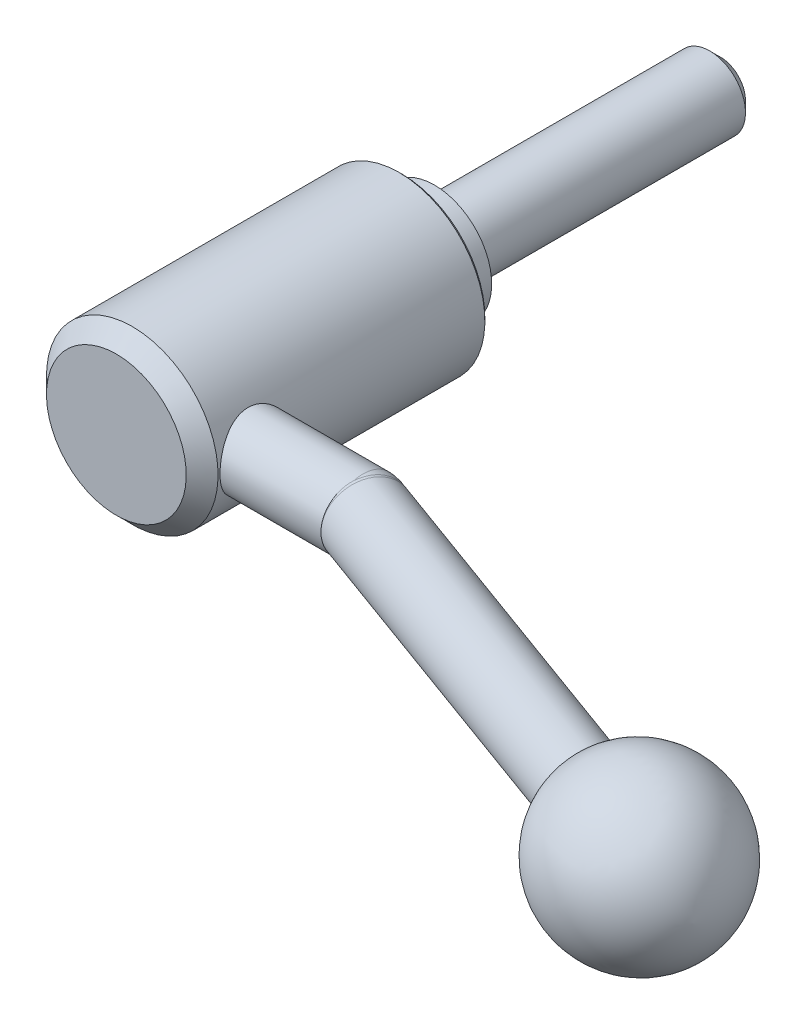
ISO-10303-21;
HEADER;
FILE_DESCRIPTION(('STEP AP214'),'2;1');
FILE_NAME('part.step','',(''),(''),'','','');
FILE_SCHEMA(('AUTOMOTIVE_DESIGN { 1 0 10303 214 1 1 1 1 }'));
ENDSEC;
DATA;
#1=APPLICATION_CONTEXT('core data for automotive mechanical design processes');
#2=APPLICATION_PROTOCOL_DEFINITION('international standard','automotive_design',2000,#1);
#3=PRODUCT_CONTEXT('',#1,'mechanical');
#4=PRODUCT('Part','Part','',(#3));
#5=PRODUCT_RELATED_PRODUCT_CATEGORY('part','',(#4));
#6=PRODUCT_DEFINITION_FORMATION('','',#4);
#7=PRODUCT_DEFINITION_CONTEXT('part definition',#1,'design');
#8=PRODUCT_DEFINITION('design','',#6,#7);
#9=PRODUCT_DEFINITION_SHAPE('','',#8);
#10=(LENGTH_UNIT() NAMED_UNIT(*) SI_UNIT(.MILLI.,.METRE.));
#11=(NAMED_UNIT(*) PLANE_ANGLE_UNIT() SI_UNIT($,.RADIAN.));
#12=(NAMED_UNIT(*) SI_UNIT($,.STERADIAN.) SOLID_ANGLE_UNIT());
#13=UNCERTAINTY_MEASURE_WITH_UNIT(LENGTH_MEASURE(1.E-05),#10,'distance_accuracy_value','');
#14=(GEOMETRIC_REPRESENTATION_CONTEXT(3) GLOBAL_UNCERTAINTY_ASSIGNED_CONTEXT((#13)) GLOBAL_UNIT_ASSIGNED_CONTEXT((#10,
#11,#12)) REPRESENTATION_CONTEXT('',''));
#15=CARTESIAN_POINT('',(0.,0.,0.));
#16=DIRECTION('',(0.,0.,1.));
#17=DIRECTION('',(1.,0.,0.));
#18=AXIS2_PLACEMENT_3D('',#15,#16,#17);
#19=CARTESIAN_POINT('',(0.,0.,0.));
#20=DIRECTION('',(0.,0.,-1.));
#21=DIRECTION('',(0.,1.,0.));
#22=AXIS2_PLACEMENT_3D('',#19,#20,#21);
#23=CYLINDRICAL_SURFACE('',#22,12.);
#24=CARTESIAN_POINT('',(0.,0.,4.95));
#25=DIRECTION('',(0.,0.,-1.));
#26=DIRECTION('',(0.,1.,0.));
#27=AXIS2_PLACEMENT_3D('',#24,#25,#26);
#28=CIRCLE('',#27,12.);
#29=CARTESIAN_POINT('',(0.,12.,4.95));
#30=VERTEX_POINT('',#29);
#31=EDGE_CURVE('E147',#30,#30,#28,.T.);
#32=ORIENTED_EDGE('',*,*,#31,.F.);
#33=EDGE_LOOP('',(#32));
#34=FACE_BOUND('',#33,.T.);
#35=CARTESIAN_POINT('',(10.9087121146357,5.,37.));
#36=CARTESIAN_POINT('',(10.9087130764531,4.99999907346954,37.1334013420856));
#37=CARTESIAN_POINT('',(10.9111675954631,4.99465346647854,37.266850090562));
#38=CARTESIAN_POINT('',(10.9209052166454,4.97332510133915,37.5327768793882));
#39=CARTESIAN_POINT('',(10.9281914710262,4.95733539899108,37.6652542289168));
#40=CARTESIAN_POINT('',(10.94736464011,4.91485001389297,37.928469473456));
#41=CARTESIAN_POINT('',(10.9592613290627,4.88833200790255,38.0592030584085));
#42=CARTESIAN_POINT('',(10.9872633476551,4.82506361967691,38.3177583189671));
#43=CARTESIAN_POINT('',(11.0033704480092,4.7883089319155,38.4455787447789));
#44=CARTESIAN_POINT('',(11.0391992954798,4.7051161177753,38.6968536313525));
#45=CARTESIAN_POINT('',(11.0589043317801,4.65872262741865,38.8203252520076));
#46=CARTESIAN_POINT('',(11.1013893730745,4.5565572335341,39.062794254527));
#47=CARTESIAN_POINT('',(11.1241705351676,4.5007817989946,39.1817899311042));
#48=CARTESIAN_POINT('',(11.1961478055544,4.3200790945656,39.5308988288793));
#49=CARTESIAN_POINT('',(11.2490254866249,4.18166963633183,39.7534507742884));
#50=CARTESIAN_POINT('',(11.3622340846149,3.86388960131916,40.185337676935));
#51=CARTESIAN_POINT('',(11.4228172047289,3.68264836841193,40.3932181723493));
#52=CARTESIAN_POINT('',(11.5425773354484,3.28805127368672,40.7768129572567));
#53=CARTESIAN_POINT('',(11.6017537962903,3.07468308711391,40.9525148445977));
#54=CARTESIAN_POINT('',(11.6861172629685,2.72939811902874,41.1918033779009));
#55=CARTESIAN_POINT('',(11.7140370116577,2.60726265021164,41.2688525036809));
#56=CARTESIAN_POINT('',(11.7670757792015,2.35633907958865,41.4123143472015));
#57=CARTESIAN_POINT('',(11.7921959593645,2.22755376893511,41.4787314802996));
#58=CARTESIAN_POINT('',(11.838917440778,1.96416180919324,41.6003389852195));
#59=CARTESIAN_POINT('',(11.8605184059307,1.82955460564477,41.6555282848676));
#60=CARTESIAN_POINT('',(11.8995529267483,1.55556138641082,41.7540939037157));
#61=CARTESIAN_POINT('',(11.9169885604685,1.41617779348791,41.7974761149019));
#62=CARTESIAN_POINT('',(11.9463943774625,1.14097065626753,41.8700493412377));
#63=CARTESIAN_POINT('',(11.9586002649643,1.00533485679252,41.8998574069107));
#64=CARTESIAN_POINT('',(11.978450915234,0.731783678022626,41.9481078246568));
#65=CARTESIAN_POINT('',(11.9860977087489,0.593869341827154,41.9665552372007));
#66=CARTESIAN_POINT('',(11.9966178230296,0.316820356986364,41.9918906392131));
#67=CARTESIAN_POINT('',(11.9994918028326,0.177685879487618,41.998780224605));
#68=CARTESIAN_POINT('',(12.0003846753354,-0.100685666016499,42.0009233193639));
#69=CARTESIAN_POINT('',(11.9984037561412,-0.239922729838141,41.9961772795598));
#70=CARTESIAN_POINT('',(11.9899136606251,-0.508875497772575,41.9757519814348));
#71=CARTESIAN_POINT('',(11.9836886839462,-0.638652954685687,41.9607587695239));
#72=CARTESIAN_POINT('',(11.9671679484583,-0.896425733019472,41.9207154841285));
#73=CARTESIAN_POINT('',(11.9568708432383,-1.02442045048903,41.8956620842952));
#74=CARTESIAN_POINT('',(11.9324642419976,-1.27768058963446,41.8357474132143));
#75=CARTESIAN_POINT('',(11.9183560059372,-1.40294689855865,41.8008893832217));
#76=CARTESIAN_POINT('',(11.8866740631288,-1.65000960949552,41.7216867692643));
#77=CARTESIAN_POINT('',(11.8690990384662,-1.77180467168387,41.6773385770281));
#78=CARTESIAN_POINT('',(11.8112061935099,-2.1344060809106,41.5291317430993));
#79=CARTESIAN_POINT('',(11.7660875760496,-2.36878813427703,41.4109765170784));
#80=CARTESIAN_POINT('',(11.6674248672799,-2.81488765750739,41.1406025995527));
#81=CARTESIAN_POINT('',(11.6138778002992,-3.02659707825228,40.9883718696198));
#82=CARTESIAN_POINT('',(11.4992708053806,-3.4373466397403,40.6416848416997));
#83=CARTESIAN_POINT('',(11.4379473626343,-3.6344418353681,40.4450085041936));
#84=CARTESIAN_POINT('',(11.317506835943,-3.9937495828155,40.0211105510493));
#85=CARTESIAN_POINT('',(11.2583906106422,-4.15594867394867,39.7938772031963));
#86=CARTESIAN_POINT('',(11.1754830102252,-4.37204843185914,39.4302315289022));
#87=CARTESIAN_POINT('',(11.1484199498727,-4.44042007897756,39.3029580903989));
#88=CARTESIAN_POINT('',(11.0975376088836,-4.5660982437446,39.0424564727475));
#89=CARTESIAN_POINT('',(11.0737170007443,-4.62340929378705,38.9092307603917));
#90=CARTESIAN_POINT('',(11.0301558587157,-4.72639308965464,38.6377673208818));
#91=CARTESIAN_POINT('',(11.010413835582,-4.77207008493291,38.4995314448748));
#92=CARTESIAN_POINT('',(10.9757324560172,-4.85130620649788,38.219039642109));
#93=CARTESIAN_POINT('',(10.9607926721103,-4.88486641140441,38.0767840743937));
#94=CARTESIAN_POINT('',(10.9370969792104,-4.93768074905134,37.7987576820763));
#95=CARTESIAN_POINT('',(10.9280027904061,-4.95772169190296,37.6631648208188));
#96=CARTESIAN_POINT('',(10.9148523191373,-4.9866073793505,37.3905520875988));
#97=CARTESIAN_POINT('',(10.9107956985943,-4.99545287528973,37.2535323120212));
#98=CARTESIAN_POINT('',(10.9078699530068,-5.00183821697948,36.9792139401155));
#99=CARTESIAN_POINT('',(10.9089993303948,-4.9993813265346,36.8419154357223));
#100=CARTESIAN_POINT('',(10.9163998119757,-4.98320111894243,36.5681288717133));
#101=CARTESIAN_POINT('',(10.9226707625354,-4.96947813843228,36.4316407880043));
#102=CARTESIAN_POINT('',(10.939564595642,-4.93217158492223,36.1692842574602));
#103=CARTESIAN_POINT('',(10.9498816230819,-4.90927900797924,36.0432974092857));
#104=CARTESIAN_POINT('',(10.9744912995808,-4.85401305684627,35.7938045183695));
#105=CARTESIAN_POINT('',(10.9887852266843,-4.82163663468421,35.6702992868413));
#106=CARTESIAN_POINT('',(11.0370194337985,-4.71071065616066,35.3047320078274));
#107=CARTESIAN_POINT('',(11.0763259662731,-4.6183356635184,35.0674195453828));
#108=CARTESIAN_POINT('',(11.1668340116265,-4.39509042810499,34.6014982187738));
#109=CARTESIAN_POINT('',(11.2184687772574,-4.26275559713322,34.3736835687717));
#110=CARTESIAN_POINT('',(11.3271978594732,-3.9648148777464,33.9423843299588));
#111=CARTESIAN_POINT('',(11.3842945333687,-3.79919458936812,33.7389103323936));
#112=CARTESIAN_POINT('',(11.5031524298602,-3.42333828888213,33.344771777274));
#113=CARTESIAN_POINT('',(11.5649149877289,-3.21056780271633,33.1564985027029));
#114=CARTESIAN_POINT('',(11.652539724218,-2.86918502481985,32.9026870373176));
#115=CARTESIAN_POINT('',(11.6809270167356,-2.75160882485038,32.8228101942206));
#116=CARTESIAN_POINT('',(11.7352796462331,-2.50969002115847,32.6731475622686));
#117=CARTESIAN_POINT('',(11.761246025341,-2.38535036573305,32.6033574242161));
#118=CARTESIAN_POINT('',(11.8101156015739,-2.13027929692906,32.4742500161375));
#119=CARTESIAN_POINT('',(11.8330091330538,-1.99952940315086,32.4149656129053));
#120=CARTESIAN_POINT('',(11.8749794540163,-1.73293321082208,32.3077113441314));
#121=CARTESIAN_POINT('',(11.8940578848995,-1.59708913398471,32.2597366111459));
#122=CARTESIAN_POINT('',(11.9278439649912,-1.32129951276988,32.1755883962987));
#123=CARTESIAN_POINT('',(11.9425527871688,-1.18135508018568,32.1394117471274));
#124=CARTESIAN_POINT('',(11.9671605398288,-0.89845467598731,32.0792595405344));
#125=CARTESIAN_POINT('',(11.9770598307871,-0.75549893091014,32.0552830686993));
#126=CARTESIAN_POINT('',(11.9912289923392,-0.477883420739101,32.021064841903));
#127=CARTESIAN_POINT('',(11.9958449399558,-0.343344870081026,32.0099778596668));
#128=CARTESIAN_POINT('',(12.0005316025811,-0.073683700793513,31.9987215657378));
#129=CARTESIAN_POINT('',(12.0006007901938,0.0614390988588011,31.9985559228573));
#130=CARTESIAN_POINT('',(11.9961887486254,0.331106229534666,32.0091516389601));
#131=CARTESIAN_POINT('',(11.9917099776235,0.465650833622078,32.0199070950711));
#132=CARTESIAN_POINT('',(11.9783256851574,0.733261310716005,32.0522225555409));
#133=CARTESIAN_POINT('',(11.9694185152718,0.866326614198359,32.0737865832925));
#134=CARTESIAN_POINT('',(11.9478093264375,1.12521434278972,32.1265303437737));
#135=CARTESIAN_POINT('',(11.9352551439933,1.25112522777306,32.1573367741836));
#136=CARTESIAN_POINT('',(11.9065633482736,1.49981842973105,32.2284909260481));
#137=CARTESIAN_POINT('',(11.8904244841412,1.62259963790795,32.2688419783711));
#138=CARTESIAN_POINT('',(11.8371898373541,1.98503132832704,32.403699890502));
#139=CARTESIAN_POINT('',(11.7952573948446,2.21898154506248,32.5120551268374));
#140=CARTESIAN_POINT('',(11.700229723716,2.67613896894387,32.7679713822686));
#141=CARTESIAN_POINT('',(11.6467156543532,2.8983828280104,32.9170829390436));
#142=CARTESIAN_POINT('',(11.5348651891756,3.31565850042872,33.248014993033));
#143=CARTESIAN_POINT('',(11.4765270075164,3.51068016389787,33.4298476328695));
#144=CARTESIAN_POINT('',(11.3565857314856,3.88182487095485,33.835823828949));
#145=CARTESIAN_POINT('',(11.2950305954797,4.05575892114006,34.0620045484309));
#146=CARTESIAN_POINT('',(11.2086213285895,4.28644220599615,34.4218577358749));
#147=CARTESIAN_POINT('',(11.1807840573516,4.35834922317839,34.5453544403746));
#148=CARTESIAN_POINT('',(11.1279493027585,4.49153302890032,34.7985115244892));
#149=CARTESIAN_POINT('',(11.1029505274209,4.55281466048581,34.9281690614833));
#150=CARTESIAN_POINT('',(11.0567342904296,4.66392927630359,35.1921877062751));
#151=CARTESIAN_POINT('',(11.0354990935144,4.7138162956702,35.3265229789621));
#152=CARTESIAN_POINT('',(10.9974167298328,4.80199267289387,35.599492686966));
#153=CARTESIAN_POINT('',(10.9805674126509,4.84028771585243,35.7381249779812));
#154=CARTESIAN_POINT('',(10.9519122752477,4.90477948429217,36.0182918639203));
#155=CARTESIAN_POINT('',(10.9400931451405,4.93100815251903,36.1598177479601));
#156=CARTESIAN_POINT('',(10.9219030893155,4.97116941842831,36.4448760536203));
#157=CARTESIAN_POINT('',(10.9155279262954,4.98511157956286,36.5884068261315));
#158=CARTESIAN_POINT('',(10.9109028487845,4.99521783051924,36.7768518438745));
#159=CARTESIAN_POINT('',(10.9100818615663,4.99701063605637,36.8214567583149));
#160=CARTESIAN_POINT('',(10.9089863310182,4.99940188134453,36.9107060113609));
#161=CARTESIAN_POINT('',(10.9087117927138,5.00000031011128,36.9553503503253));
#162=CARTESIAN_POINT('',(10.9087121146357,5.,37.));
#163=B_SPLINE_CURVE_WITH_KNOTS('',3,(#35,#36,#37,#38,#39,#40,#41,#42,#43,#44,#45,#46,#47,#48,
#49,#50,#51,#52,#53,#54,#55,#56,#57,#58,#59,#60,#61,#62,#63,#64,#65,#66,#67,#68,#69,#70,#71,#72,
#73,#74,#75,#76,#77,#78,#79,#80,#81,#82,#83,#84,#85,#86,#87,#88,#89,#90,#91,#92,#93,#94,#95,#96,
#97,#98,#99,#100,#101,#102,#103,#104,#105,#106,#107,#108,#109,#110,#111,#112,#113,#114,#115,
#116,#117,#118,#119,#120,#121,#122,#123,#124,#125,#126,#127,#128,#129,#130,#131,#132,#133,#134,
#135,#136,#137,#138,#139,#140,#141,#142,#143,#144,#145,#146,#147,#148,#149,#150,#151,#152,#153,
#154,#155,#156,#157,#158,#159,#160,#161,#162),.UNSPECIFIED.,.T.,.F.,(4,2,2,2,2,2,2,2,2,2,2,2,2,
2,2,2,2,2,2,2,2,2,2,2,2,2,2,2,2,2,2,2,2,2,2,2,2,2,2,2,2,2,2,2,2,2,2,2,2,2,2,2,2,2,2,2,2,2,2,2,2,
2,2,4),(0.,0.400157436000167,0.800576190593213,1.20184852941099,1.60328989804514,
2.00291210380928,2.40268505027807,3.20123019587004,4.04483609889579,4.88876646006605,
5.32954710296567,5.77014421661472,6.21078338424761,6.65120225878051,7.06888225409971,
7.48637606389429,7.90381222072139,8.32123220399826,8.71313663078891,9.10517074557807,
9.49707541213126,9.88912935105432,10.6843842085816,11.4799204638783,12.3315328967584,
13.1834732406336,13.6239634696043,14.064272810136,14.5044210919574,14.9445301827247,
15.3560893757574,15.7676209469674,16.1790336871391,16.5904341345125,16.9753736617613,
17.3604370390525,18.129966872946,18.9320860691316,19.7345530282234,20.6023475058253,
21.0367677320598,21.4710000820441,21.9065678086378,22.3419477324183,22.7772106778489,
23.2124409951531,23.6171514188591,24.0219977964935,24.4266254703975,24.8314038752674,
25.2216396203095,25.6120117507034,26.3921129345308,27.2074696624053,28.0231295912,
28.8942922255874,29.3306260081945,29.7667603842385,30.2007814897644,30.6345893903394,
31.067242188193,31.4995579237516,31.6334900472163,31.7674234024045),.UNSPECIFIED.);
#164=CARTESIAN_POINT('',(10.9087121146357,5.,37.));
#165=VERTEX_POINT('',#164);
#166=EDGE_CURVE('E77',#165,#165,#163,.T.);
#167=ORIENTED_EDGE('',*,*,#166,.F.);
#168=EDGE_LOOP('',(#167));
#169=FACE_BOUND('',#168,.T.);
#170=CARTESIAN_POINT('',(0.,0.,42.275));
#171=DIRECTION('',(0.,0.,-1.));
#172=DIRECTION('',(0.,1.,0.));
#173=AXIS2_PLACEMENT_3D('',#170,#171,#172);
#174=CIRCLE('',#173,12.);
#175=CARTESIAN_POINT('',(0.,12.,42.275));
#176=VERTEX_POINT('',#175);
#177=EDGE_CURVE('E149',#176,#176,#174,.T.);
#178=ORIENTED_EDGE('',*,*,#177,.T.);
#179=EDGE_LOOP('',(#178));
#180=FACE_BOUND('',#179,.T.);
#181=ADVANCED_FACE('F14',(#34,#169,#180),#23,.T.);
#182=CARTESIAN_POINT('',(0.,0.,44.5));
#183=DIRECTION('',(0.,0.,-1.));
#184=DIRECTION('',(0.,1.,0.));
#185=AXIS2_PLACEMENT_3D('',#182,#183,#184);
#186=PLANE('',#185);
#187=CARTESIAN_POINT('',(0.,0.,44.5));
#188=DIRECTION('',(0.,0.,-1.));
#189=DIRECTION('',(0.,1.,0.));
#190=AXIS2_PLACEMENT_3D('',#187,#188,#189);
#191=CIRCLE('',#190,9.775);
#192=CARTESIAN_POINT('',(0.,9.775,44.5));
#193=VERTEX_POINT('',#192);
#194=EDGE_CURVE('E85',#193,#193,#191,.T.);
#195=ORIENTED_EDGE('',*,*,#194,.F.);
#196=EDGE_LOOP('',(#195));
#197=FACE_BOUND('',#196,.T.);
#198=ADVANCED_FACE('F61',(#197),#186,.F.);
#199=CARTESIAN_POINT('',(0.,0.,44.5));
#200=DIRECTION('',(0.,0.,-1.));
#201=DIRECTION('',(0.,1.,0.));
#202=AXIS2_PLACEMENT_3D('',#199,#200,#201);
#203=CONICAL_SURFACE('',#202,9.775,0.785398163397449);
#204=ORIENTED_EDGE('',*,*,#177,.F.);
#205=EDGE_LOOP('',(#204));
#206=FACE_BOUND('',#205,.T.);
#207=ORIENTED_EDGE('',*,*,#194,.T.);
#208=EDGE_LOOP('',(#207));
#209=FACE_BOUND('',#208,.T.);
#210=ADVANCED_FACE('F67',(#206,#209),#203,.T.);
#211=CARTESIAN_POINT('',(0.,0.,4.95));
#212=DIRECTION('',(0.,0.,1.));
#213=DIRECTION('',(0.,-1.,0.));
#214=AXIS2_PLACEMENT_3D('',#211,#212,#213);
#215=CONICAL_SURFACE('',#214,12.,0.785398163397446);
#216=CARTESIAN_POINT('',(0.,0.,4.5));
#217=DIRECTION('',(0.,0.,-1.));
#218=DIRECTION('',(0.,1.,0.));
#219=AXIS2_PLACEMENT_3D('',#216,#217,#218);
#220=CIRCLE('',#219,11.55);
#221=CARTESIAN_POINT('',(0.,11.55,4.5));
#222=VERTEX_POINT('',#221);
#223=EDGE_CURVE('E142',#222,#222,#220,.T.);
#224=ORIENTED_EDGE('',*,*,#223,.F.);
#225=EDGE_LOOP('',(#224));
#226=FACE_BOUND('',#225,.T.);
#227=ORIENTED_EDGE('',*,*,#31,.T.);
#228=EDGE_LOOP('',(#227));
#229=FACE_BOUND('',#228,.T.);
#230=ADVANCED_FACE('F74',(#226,#229),#215,.T.);
#231=CARTESIAN_POINT('',(11.55,0.,4.5));
#232=DIRECTION('',(0.,0.,1.));
#233=DIRECTION('',(0.,-1.,0.));
#234=AXIS2_PLACEMENT_3D('',#231,#232,#233);
#235=PLANE('',#234);
#236=CARTESIAN_POINT('',(0.,0.,4.5));
#237=DIRECTION('',(0.,0.,-1.));
#238=DIRECTION('',(0.,1.,0.));
#239=AXIS2_PLACEMENT_3D('',#236,#237,#238);
#240=CIRCLE('',#239,8.);
#241=CARTESIAN_POINT('',(0.,8.,4.5));
#242=VERTEX_POINT('',#241);
#243=EDGE_CURVE('E140',#242,#242,#240,.T.);
#244=ORIENTED_EDGE('',*,*,#243,.F.);
#245=EDGE_LOOP('',(#244));
#246=FACE_BOUND('',#245,.T.);
#247=ORIENTED_EDGE('',*,*,#223,.T.);
#248=EDGE_LOOP('',(#247));
#249=FACE_BOUND('',#248,.T.);
#250=ADVANCED_FACE('F161',(#246,#249),#235,.F.);
#251=CARTESIAN_POINT('',(0.,0.,0.));
#252=DIRECTION('',(0.,0.,-1.));
#253=DIRECTION('',(0.,1.,0.));
#254=AXIS2_PLACEMENT_3D('',#251,#252,#253);
#255=CYLINDRICAL_SURFACE('',#254,8.);
#256=CARTESIAN_POINT('',(0.,0.,0.));
#257=DIRECTION('',(0.,0.,-1.));
#258=DIRECTION('',(0.,1.,0.));
#259=AXIS2_PLACEMENT_3D('',#256,#257,#258);
#260=CIRCLE('',#259,8.);
#261=CARTESIAN_POINT('',(0.,8.,0.));
#262=VERTEX_POINT('',#261);
#263=EDGE_CURVE('E138',#262,#262,#260,.T.);
#264=ORIENTED_EDGE('',*,*,#263,.F.);
#265=EDGE_LOOP('',(#264));
#266=FACE_BOUND('',#265,.T.);
#267=ORIENTED_EDGE('',*,*,#243,.T.);
#268=EDGE_LOOP('',(#267));
#269=FACE_BOUND('',#268,.T.);
#270=ADVANCED_FACE('F135',(#266,#269),#255,.T.);
#271=CARTESIAN_POINT('',(8.,0.,0.));
#272=DIRECTION('',(0.,0.,1.));
#273=DIRECTION('',(0.,-1.,0.));
#274=AXIS2_PLACEMENT_3D('',#271,#272,#273);
#275=PLANE('',#274);
#276=CARTESIAN_POINT('',(0.,0.,0.));
#277=DIRECTION('',(0.,0.,-1.));
#278=DIRECTION('',(0.,1.,0.));
#279=AXIS2_PLACEMENT_3D('',#276,#277,#278);
#280=CIRCLE('',#279,5.);
#281=CARTESIAN_POINT('',(0.,5.,0.));
#282=VERTEX_POINT('',#281);
#283=EDGE_CURVE('E126',#282,#282,#280,.T.);
#284=ORIENTED_EDGE('',*,*,#283,.F.);
#285=EDGE_LOOP('',(#284));
#286=FACE_BOUND('',#285,.T.);
#287=ORIENTED_EDGE('',*,*,#263,.T.);
#288=EDGE_LOOP('',(#287));
#289=FACE_BOUND('',#288,.T.);
#290=ADVANCED_FACE('F93',(#286,#289),#275,.F.);
#291=CARTESIAN_POINT('',(32.,0.,37.));
#292=DIRECTION('',(1.,0.,0.));
#293=DIRECTION('',(0.,1.,0.));
#294=AXIS2_PLACEMENT_3D('',#291,#292,#293);
#295=CYLINDRICAL_SURFACE('',#294,5.);
#296=CARTESIAN_POINT('',(27.0002,-4.83117434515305,38.2883145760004));
#297=CARTESIAN_POINT('',(26.9771151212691,-4.81425533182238,38.3517716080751));
#298=CARTESIAN_POINT('',(26.9549711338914,-4.79599919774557,38.4151983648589));
#299=CARTESIAN_POINT('',(26.9123130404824,-4.75682023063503,38.5417664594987));
#300=CARTESIAN_POINT('',(26.8917987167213,-4.73589775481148,38.6049078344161));
#301=CARTESIAN_POINT('',(26.8323357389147,-4.66915958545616,38.7935221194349));
#302=CARTESIAN_POINT('',(26.7954419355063,-4.61935429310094,38.9182563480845));
#303=CARTESIAN_POINT('',(26.7260075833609,-4.50939025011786,39.1641477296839));
#304=CARTESIAN_POINT('',(26.69346300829,-4.4492411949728,39.2853081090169));
#305=CARTESIAN_POINT('',(26.631969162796,-4.3188661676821,39.5230484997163));
#306=CARTESIAN_POINT('',(26.6030201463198,-4.2486394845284,39.6396281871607));
#307=CARTESIAN_POINT('',(26.5482810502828,-4.09859694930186,39.8670626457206));
#308=CARTESIAN_POINT('',(26.5224880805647,-4.01879000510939,39.9779226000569));
#309=CARTESIAN_POINT('',(26.4737060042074,-3.85000176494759,40.1931483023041));
#310=CARTESIAN_POINT('',(26.4507179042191,-3.76101719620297,40.2975117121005));
#311=CARTESIAN_POINT('',(26.4073462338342,-3.57452106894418,40.4988018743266));
#312=CARTESIAN_POINT('',(26.3869613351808,-3.47701390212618,40.595732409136));
#313=CARTESIAN_POINT('',(26.3486169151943,-3.27404367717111,40.7814771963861));
#314=CARTESIAN_POINT('',(26.330658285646,-3.16857771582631,40.8702884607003));
#315=CARTESIAN_POINT('',(26.2968878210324,-2.94931894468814,41.0399164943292));
#316=CARTESIAN_POINT('',(26.2810998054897,-2.83545204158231,41.1206422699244));
#317=CARTESIAN_POINT('',(26.2517972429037,-2.60111411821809,41.2724351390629));
#318=CARTESIAN_POINT('',(26.2382835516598,-2.48064063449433,41.3434985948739));
#319=CARTESIAN_POINT('',(26.2134747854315,-2.23400638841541,41.4753507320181));
#320=CARTESIAN_POINT('',(26.2021792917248,-2.10784670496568,41.5361413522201));
#321=CARTESIAN_POINT('',(26.1817528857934,-1.850678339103,41.6469996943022));
#322=CARTESIAN_POINT('',(26.1726227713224,-1.71966789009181,41.6970634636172));
#323=CARTESIAN_POINT('',(26.1565659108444,-1.45489437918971,41.7856658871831));
#324=CARTESIAN_POINT('',(26.1496212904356,-1.32116370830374,41.8242978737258));
#325=CARTESIAN_POINT('',(26.1378073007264,-1.05084556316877,41.8903082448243));
#326=CARTESIAN_POINT('',(26.1329387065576,-0.914257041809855,41.9176824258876));
#327=CARTESIAN_POINT('',(26.121432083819,-0.501829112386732,41.9825129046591));
#328=CARTESIAN_POINT('',(26.1178737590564,-0.223000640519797,42.0027862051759));
#329=CARTESIAN_POINT('',(26.1189625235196,0.332703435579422,41.9966121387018));
#330=CARTESIAN_POINT('',(26.1235681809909,0.609581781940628,41.9704006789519));
#331=CARTESIAN_POINT('',(26.1365918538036,1.01839236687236,41.8971560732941));
#332=CARTESIAN_POINT('',(26.1419571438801,1.15365429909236,41.8670594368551));
#333=CARTESIAN_POINT('',(26.1547482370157,1.42110904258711,41.7957866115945));
#334=CARTESIAN_POINT('',(26.162173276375,1.55330297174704,41.7546145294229));
#335=CARTESIAN_POINT('',(26.1791117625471,1.81374291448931,41.661488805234));
#336=CARTESIAN_POINT('',(26.1886259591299,1.94198749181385,41.6095312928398));
#337=CARTESIAN_POINT('',(26.2097731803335,2.19354456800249,41.4952682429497));
#338=CARTESIAN_POINT('',(26.2214054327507,2.3168588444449,41.4329664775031));
#339=CARTESIAN_POINT('',(26.2468425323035,2.55777038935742,41.2984703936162));
#340=CARTESIAN_POINT('',(26.2606478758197,2.67536634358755,41.2262738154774));
#341=CARTESIAN_POINT('',(26.2904898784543,2.90395912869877,41.0725891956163));
#342=CARTESIAN_POINT('',(26.3065257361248,3.01495830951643,40.991104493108));
#343=CARTESIAN_POINT('',(26.3410146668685,3.23022663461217,40.8189957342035));
#344=CARTESIAN_POINT('',(26.3594803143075,3.33445623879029,40.7283247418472));
#345=CARTESIAN_POINT('',(26.3988776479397,3.53478388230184,40.5389677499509));
#346=CARTESIAN_POINT('',(26.4198084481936,3.63088482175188,40.440284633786));
#347=CARTESIAN_POINT('',(26.4643216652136,3.81440211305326,40.2356199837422));
#348=CARTESIAN_POINT('',(26.4879053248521,3.90181435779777,40.1296350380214));
#349=CARTESIAN_POINT('',(26.5379464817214,4.06730764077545,39.9113164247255));
#350=CARTESIAN_POINT('',(26.564402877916,4.14539223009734,39.7989851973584));
#351=CARTESIAN_POINT('',(26.6190846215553,4.28799916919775,39.5748364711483));
#352=CARTESIAN_POINT('',(26.6471479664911,4.35301377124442,39.463292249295));
#353=CARTESIAN_POINT('',(26.7066083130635,4.47390595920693,39.2362277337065));
#354=CARTESIAN_POINT('',(26.7380049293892,4.52978459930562,39.1207079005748));
#355=CARTESIAN_POINT('',(26.8047544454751,4.63216753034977,38.8866145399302));
#356=CARTESIAN_POINT('',(26.8401091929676,4.67866741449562,38.7680396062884));
#357=CARTESIAN_POINT('',(26.915981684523,4.76212497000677,38.529146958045));
#358=CARTESIAN_POINT('',(26.9565014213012,4.79907894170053,38.4088285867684));
#359=CARTESIAN_POINT('',(27.000199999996,4.8311743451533,38.2883145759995));
#360=B_SPLINE_CURVE_WITH_KNOTS('',3,(#296,#297,#298,#299,#300,#301,#302,#303,#304,#305,#306,
#307,#308,#309,#310,#311,#312,#313,#314,#315,#316,#317,#318,#319,#320,#321,#322,#323,#324,#325,
#326,#327,#328,#329,#330,#331,#332,#333,#334,#335,#336,#337,#338,#339,#340,#341,#342,#343,#344,
#345,#346,#347,#348,#349,#350,#351,#352,#353,#354,#355,#356,#357,#358,#359),.UNSPECIFIED.,.F.,
.F.,(4,2,2,2,2,2,2,2,2,2,2,2,2,2,2,2,2,2,2,2,2,2,2,2,2,2,2,2,2,2,2,4),(0.,0.208793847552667,
0.417559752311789,0.834859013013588,1.25176923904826,1.66870889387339,2.08526383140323,
2.50196783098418,2.91845835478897,3.33510154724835,3.75600341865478,4.17706331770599,
4.5980436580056,5.01917885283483,5.43677439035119,5.85452571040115,6.68900674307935,
7.51926494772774,7.93487433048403,8.35032982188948,8.76593465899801,9.18138827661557,
9.59693693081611,10.0123366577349,10.4299775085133,10.8474687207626,11.2651563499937,
11.6826844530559,12.078641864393,12.4745535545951,12.870650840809,13.2669014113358),.UNSPECIFIED.);
#361=CARTESIAN_POINT('',(27.,-4.83102779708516,38.2888640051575));
#362=VERTEX_POINT('',#361);
#363=CARTESIAN_POINT('',(26.1183650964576,0.,42.));
#364=VERTEX_POINT('',#363);
#365=EDGE_CURVE('E29',#362,#364,#360,.T.);
#366=ORIENTED_EDGE('',*,*,#365,.T.);
#367=CARTESIAN_POINT('',(27.,4.83102779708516,38.2888640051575));
#368=VERTEX_POINT('',#367);
#369=EDGE_CURVE('E98',#364,#368,#360,.T.);
#370=ORIENTED_EDGE('',*,*,#369,.T.);
#371=CARTESIAN_POINT('',(27.,0.,37.));
#372=DIRECTION('',(1.,0.,0.));
#373=DIRECTION('',(0.,1.,0.));
#374=AXIS2_PLACEMENT_3D('',#371,#372,#373);
#375=CIRCLE('',#374,5.);
#376=EDGE_CURVE('E107',#362,#368,#375,.T.);
#377=ORIENTED_EDGE('',*,*,#376,.F.);
#378=EDGE_LOOP('',(#366,#370,#377));
#379=FACE_BOUND('',#378,.T.);
#380=ORIENTED_EDGE('',*,*,#166,.T.);
#381=EDGE_LOOP('',(#380));
#382=FACE_BOUND('',#381,.T.);
#383=ADVANCED_FACE('F87',(#379,#382),#295,.T.);
#384=CARTESIAN_POINT('',(27.,0.,37.));
#385=DIRECTION('',(1.,0.,0.));
#386=DIRECTION('',(0.,0.,1.));
#387=AXIS2_PLACEMENT_3D('',#384,#385,#386);
#388=SPHERICAL_SURFACE('',#387,5.);
#389=CARTESIAN_POINT('',(27.4142329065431,0.,37.1507684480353));
#390=DIRECTION('',(0.939692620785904,0.,0.342020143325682));
#391=DIRECTION('',(-0.342020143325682,0.,0.939692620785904));
#392=AXIS2_PLACEMENT_3D('',#389,#390,#391);
#393=CIRCLE('',#392,4.98053008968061);
#394=EDGE_CURVE('E36',#362,#368,#393,.T.);
#395=ORIENTED_EDGE('',*,*,#394,.F.);
#396=ORIENTED_EDGE('',*,*,#376,.T.);
#397=EDGE_LOOP('',(#395,#396));
#398=FACE_BOUND('',#397,.T.);
#399=ADVANCED_FACE('F92',(#398),#388,.T.);
#400=CARTESIAN_POINT('',(27.828465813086,0.,37.3015368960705));
#401=DIRECTION('',(0.939692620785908,0.,0.342020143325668));
#402=DIRECTION('',(-0.342020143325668,0.,0.939692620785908));
#403=AXIS2_PLACEMENT_3D('',#400,#401,#402);
#404=SPHERICAL_SURFACE('',#403,5.);
#405=ORIENTED_EDGE('',*,*,#365,.F.);
#406=ORIENTED_EDGE('',*,*,#394,.T.);
#407=ORIENTED_EDGE('',*,*,#369,.F.);
#408=CARTESIAN_POINT('',(27.8284658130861,0.,37.3015368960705));
#409=DIRECTION('',(0.939692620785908,0.,0.342020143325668));
#410=DIRECTION('',(-0.342020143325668,0.,0.939692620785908));
#411=AXIS2_PLACEMENT_3D('',#408,#409,#410);
#412=CIRCLE('',#411,5.);
#413=EDGE_CURVE('E105',#364,#364,#412,.T.);
#414=ORIENTED_EDGE('',*,*,#413,.F.);
#415=EDGE_LOOP('',(#405,#406,#407,#414));
#416=FACE_BOUND('',#415,.T.);
#417=ADVANCED_FACE('F109',(#416),#404,.T.);
#418=CARTESIAN_POINT('',(99.5041035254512,0.,63.3893355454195));
#419=DIRECTION('',(0.939692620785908,0.,0.342020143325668));
#420=DIRECTION('',(-0.342020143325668,0.,0.939692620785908));
#421=AXIS2_PLACEMENT_3D('',#418,#419,#420);
#422=CYLINDRICAL_SURFACE('',#421,5.);
#423=CARTESIAN_POINT('',(78.3773961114,0.,55.6998428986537));
#424=DIRECTION('',(0.939692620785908,0.,0.342020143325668));
#425=DIRECTION('',(-0.342020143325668,0.,0.939692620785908));
#426=AXIS2_PLACEMENT_3D('',#423,#424,#425);
#427=CIRCLE('',#426,5.);
#428=CARTESIAN_POINT('',(76.6672953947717,0.,60.3983060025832));
#429=VERTEX_POINT('',#428);
#430=EDGE_CURVE('E121',#429,#429,#427,.T.);
#431=ORIENTED_EDGE('',*,*,#430,.F.);
#432=EDGE_LOOP('',(#431));
#433=FACE_BOUND('',#432,.T.);
#434=ORIENTED_EDGE('',*,*,#413,.T.);
#435=EDGE_LOOP('',(#434));
#436=FACE_BOUND('',#435,.T.);
#437=ADVANCED_FACE('F56',(#433,#436),#422,.T.);
#438=CARTESIAN_POINT('',(76.6672953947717,0.,60.3983060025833));
#439=DIRECTION('',(0.939692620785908,0.,0.342020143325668));
#440=DIRECTION('',(-0.342020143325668,0.,0.939692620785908));
#441=AXIS2_PLACEMENT_3D('',#438,#439,#440);
#442=PLANE('',#441);
#443=CARTESIAN_POINT('',(78.3773961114,0.,55.6998428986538));
#444=DIRECTION('',(0.939692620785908,0.,0.342020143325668));
#445=DIRECTION('',(-0.342020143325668,0.,0.939692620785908));
#446=AXIS2_PLACEMENT_3D('',#443,#444,#445);
#447=CIRCLE('',#446,6.84016260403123);
#448=CARTESIAN_POINT('',(76.0379227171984,0.,62.1274932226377));
#449=VERTEX_POINT('',#448);
#450=EDGE_CURVE('E124',#449,#449,#447,.T.);
#451=ORIENTED_EDGE('',*,*,#450,.F.);
#452=EDGE_LOOP('',(#451));
#453=FACE_BOUND('',#452,.T.);
#454=ORIENTED_EDGE('',*,*,#430,.T.);
#455=EDGE_LOOP('',(#454));
#456=FACE_BOUND('',#455,.T.);
#457=ADVANCED_FACE('F45',(#453,#456),#442,.F.);
#458=CARTESIAN_POINT('',(88.,0.,58.5));
#459=DIRECTION('',(0.,0.999999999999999,0.));
#460=DIRECTION('',(-0.342020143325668,0.,0.939692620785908));
#461=AXIS2_PLACEMENT_3D('',#458,#459,#460);
#462=CIRCLE('',#461,12.5);
#463=TRIMMED_CURVE('',#462,(PARAMETER_VALUE(-1.51798478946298)),
(PARAMETER_VALUE(1.51798478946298)),.T.,.PARAMETER.);
#464=CARTESIAN_POINT('',(87.7743223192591,0.,59.1200443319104));
#465=DIRECTION('',(0.939692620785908,0.,0.342020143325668));
#466=AXIS1_PLACEMENT('',#464,#465);
#467=SURFACE_OF_REVOLUTION('',#463,#466);
#468=ORIENTED_EDGE('',*,*,#450,.T.);
#469=EDGE_LOOP('',(#468));
#470=FACE_BOUND('',#469,.T.);
#471=CARTESIAN_POINT('',(99.5041035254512,0.,63.3893355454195));
#472=VERTEX_POINT('',#471);
#473=VERTEX_LOOP('',#472);
#474=FACE_BOUND('',#473,.T.);
#475=ADVANCED_FACE('F42',(#470,#474),#467,.T.);
#476=CARTESIAN_POINT('',(0.,0.,14.));
#477=DIRECTION('',(0.,0.,-1.));
#478=DIRECTION('',(-1.,0.,0.));
#479=AXIS2_PLACEMENT_3D('',#476,#477,#478);
#480=CYLINDRICAL_SURFACE('',#479,5.);
#481=CARTESIAN_POINT('',(0.,0.,-38.5));
#482=DIRECTION('',(0.,0.,-1.));
#483=DIRECTION('',(-1.,0.,0.));
#484=AXIS2_PLACEMENT_3D('',#481,#482,#483);
#485=CIRCLE('',#484,5.);
#486=CARTESIAN_POINT('',(-5.,0.,-38.5));
#487=VERTEX_POINT('',#486);
#488=EDGE_CURVE('E9',#487,#487,#485,.F.);
#489=ORIENTED_EDGE('',*,*,#488,.T.);
#490=EDGE_LOOP('',(#489));
#491=FACE_BOUND('',#490,.T.);
#492=ORIENTED_EDGE('',*,*,#283,.T.);
#493=EDGE_LOOP('',(#492));
#494=FACE_BOUND('',#493,.T.);
#495=ADVANCED_FACE('F44',(#491,#494),#480,.T.);
#496=CARTESIAN_POINT('',(0.,0.,-40.));
#497=DIRECTION('',(0.,0.,-1.));
#498=DIRECTION('',(-1.,0.,0.));
#499=AXIS2_PLACEMENT_3D('',#496,#497,#498);
#500=PLANE('',#499);
#501=CARTESIAN_POINT('',(0.,0.,-40.));
#502=DIRECTION('',(0.,0.,-1.));
#503=DIRECTION('',(-1.,0.,0.));
#504=AXIS2_PLACEMENT_3D('',#501,#502,#503);
#505=CIRCLE('',#504,3.5);
#506=CARTESIAN_POINT('',(-3.5,0.,-40.));
#507=VERTEX_POINT('',#506);
#508=EDGE_CURVE('E22',#507,#507,#505,.T.);
#509=ORIENTED_EDGE('',*,*,#508,.T.);
#510=EDGE_LOOP('',(#509));
#511=FACE_BOUND('',#510,.T.);
#512=ADVANCED_FACE('F53',(#511),#500,.T.);
#513=CARTESIAN_POINT('',(0.,0.,-40.));
#514=DIRECTION('',(0.,0.,1.));
#515=DIRECTION('',(1.,0.,0.));
#516=AXIS2_PLACEMENT_3D('',#513,#514,#515);
#517=CONICAL_SURFACE('',#516,3.5,0.785398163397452);
#518=ORIENTED_EDGE('',*,*,#488,.F.);
#519=EDGE_LOOP('',(#518));
#520=FACE_BOUND('',#519,.T.);
#521=ORIENTED_EDGE('',*,*,#508,.F.);
#522=EDGE_LOOP('',(#521));
#523=FACE_BOUND('',#522,.T.);
#524=ADVANCED_FACE('F16',(#520,#523),#517,.T.);
#525=CLOSED_SHELL('',(#181,#198,#210,#230,#250,#270,#290,#383,#399,#417,#437,#457,#475,#495,
#512,#524));
#526=MANIFOLD_SOLID_BREP('B1',#525);
#527=ADVANCED_BREP_SHAPE_REPRESENTATION('',(#18,#526),#14);
#528=SHAPE_DEFINITION_REPRESENTATION(#9,#527);
ENDSEC;
END-ISO-10303-21;
